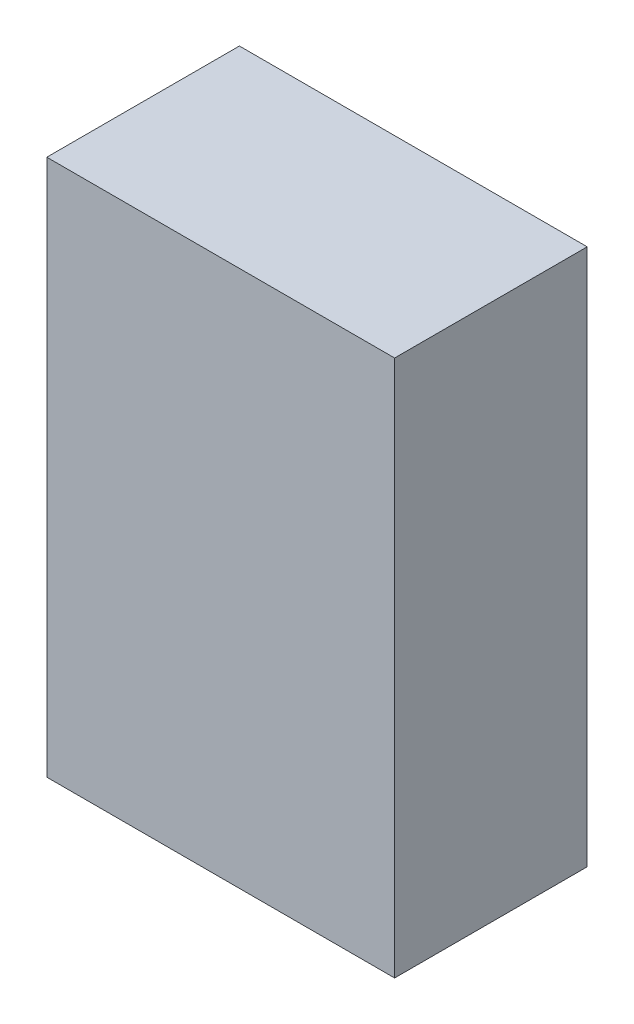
ISO-10303-21;
HEADER;
FILE_DESCRIPTION(('STEP AP214'),'2;1');
FILE_NAME('part.step','',(''),(''),'','','');
FILE_SCHEMA(('AUTOMOTIVE_DESIGN { 1 0 10303 214 1 1 1 1 }'));
ENDSEC;
DATA;
#1=APPLICATION_CONTEXT('core data for automotive mechanical design processes');
#2=APPLICATION_PROTOCOL_DEFINITION('international standard','automotive_design',2000,#1);
#3=PRODUCT_CONTEXT('',#1,'mechanical');
#4=PRODUCT('Part','Part','',(#3));
#5=PRODUCT_RELATED_PRODUCT_CATEGORY('part','',(#4));
#6=PRODUCT_DEFINITION_FORMATION('','',#4);
#7=PRODUCT_DEFINITION_CONTEXT('part definition',#1,'design');
#8=PRODUCT_DEFINITION('design','',#6,#7);
#9=PRODUCT_DEFINITION_SHAPE('','',#8);
#10=(LENGTH_UNIT() NAMED_UNIT(*) SI_UNIT(.MILLI.,.METRE.));
#11=(NAMED_UNIT(*) PLANE_ANGLE_UNIT() SI_UNIT($,.RADIAN.));
#12=(NAMED_UNIT(*) SI_UNIT($,.STERADIAN.) SOLID_ANGLE_UNIT());
#13=UNCERTAINTY_MEASURE_WITH_UNIT(LENGTH_MEASURE(1.E-05),#10,'distance_accuracy_value','');
#14=(GEOMETRIC_REPRESENTATION_CONTEXT(3) GLOBAL_UNCERTAINTY_ASSIGNED_CONTEXT((#13)) GLOBAL_UNIT_ASSIGNED_CONTEXT((#10,
#11,#12)) REPRESENTATION_CONTEXT('',''));
#15=CARTESIAN_POINT('',(0.,0.,0.));
#16=DIRECTION('',(0.,0.,1.));
#17=DIRECTION('',(1.,0.,0.));
#18=AXIS2_PLACEMENT_3D('',#15,#16,#17);
#19=CARTESIAN_POINT('',(-0.379619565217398,0.759239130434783,63.5));
#20=DIRECTION('',(1.,0.,0.));
#21=DIRECTION('',(0.,0.,-1.));
#22=AXIS2_PLACEMENT_3D('',#19,#20,#21);
#23=PLANE('',#22);
#24=DIRECTION('',(0.,-1.,0.));
#25=VECTOR('',#24,1.);
#26=CARTESIAN_POINT('',(-0.379619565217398,0.759239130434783,0.));
#27=LINE('',#26,#25);
#28=CARTESIAN_POINT('',(-0.379619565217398,177.8,0.));
#29=VERTEX_POINT('',#28);
#30=CARTESIAN_POINT('',(-0.379619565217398,0.759239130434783,0.));
#31=VERTEX_POINT('',#30);
#32=EDGE_CURVE('E74',#29,#31,#27,.T.);
#33=ORIENTED_EDGE('',*,*,#32,.T.);
#34=DIRECTION('',(0.,0.,-1.));
#35=VECTOR('',#34,1.);
#36=CARTESIAN_POINT('',(-0.379619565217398,0.759239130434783,63.5));
#37=LINE('',#36,#35);
#38=CARTESIAN_POINT('',(-0.379619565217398,0.759239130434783,63.5));
#39=VERTEX_POINT('',#38);
#40=EDGE_CURVE('E11',#39,#31,#37,.T.);
#41=ORIENTED_EDGE('',*,*,#40,.F.);
#42=DIRECTION('',(0.,-1.,0.));
#43=VECTOR('',#42,1.);
#44=CARTESIAN_POINT('',(-0.379619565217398,0.759239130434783,63.5));
#45=LINE('',#44,#43);
#46=CARTESIAN_POINT('',(-0.379619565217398,177.8,63.5));
#47=VERTEX_POINT('',#46);
#48=EDGE_CURVE('E92',#47,#39,#45,.T.);
#49=ORIENTED_EDGE('',*,*,#48,.F.);
#50=DIRECTION('',(0.,0.,-1.));
#51=VECTOR('',#50,1.);
#52=CARTESIAN_POINT('',(-0.379619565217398,177.8,63.5));
#53=LINE('',#52,#51);
#54=EDGE_CURVE('E86',#47,#29,#53,.T.);
#55=ORIENTED_EDGE('',*,*,#54,.T.);
#56=EDGE_LOOP('',(#33,#41,#49,#55));
#57=FACE_BOUND('',#56,.T.);
#58=ADVANCED_FACE('F30',(#57),#23,.F.);
#59=CARTESIAN_POINT('',(-0.379619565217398,0.759239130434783,63.5));
#60=DIRECTION('',(0.,1.,0.));
#61=DIRECTION('',(0.,0.,1.));
#62=AXIS2_PLACEMENT_3D('',#59,#60,#61);
#63=PLANE('',#62);
#64=DIRECTION('',(1.,0.,0.));
#65=VECTOR('',#64,1.);
#66=CARTESIAN_POINT('',(-0.379619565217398,0.759239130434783,0.));
#67=LINE('',#66,#65);
#68=CARTESIAN_POINT('',(114.3,0.759239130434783,0.));
#69=VERTEX_POINT('',#68);
#70=EDGE_CURVE('E70',#31,#69,#67,.T.);
#71=ORIENTED_EDGE('',*,*,#70,.T.);
#72=DIRECTION('',(0.,0.,-1.));
#73=VECTOR('',#72,1.);
#74=CARTESIAN_POINT('',(114.3,0.759239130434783,63.5));
#75=LINE('',#74,#73);
#76=CARTESIAN_POINT('',(114.3,0.759239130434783,63.5));
#77=VERTEX_POINT('',#76);
#78=EDGE_CURVE('E37',#77,#69,#75,.T.);
#79=ORIENTED_EDGE('',*,*,#78,.F.);
#80=DIRECTION('',(1.,0.,0.));
#81=VECTOR('',#80,1.);
#82=CARTESIAN_POINT('',(-0.379619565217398,0.759239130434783,63.5));
#83=LINE('',#82,#81);
#84=EDGE_CURVE('E82',#39,#77,#83,.T.);
#85=ORIENTED_EDGE('',*,*,#84,.F.);
#86=ORIENTED_EDGE('',*,*,#40,.T.);
#87=EDGE_LOOP('',(#71,#79,#85,#86));
#88=FACE_BOUND('',#87,.T.);
#89=ADVANCED_FACE('F81',(#88),#63,.F.);
#90=CARTESIAN_POINT('',(114.3,0.759239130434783,63.5));
#91=DIRECTION('',(-1.,0.,0.));
#92=DIRECTION('',(0.,0.,1.));
#93=AXIS2_PLACEMENT_3D('',#90,#91,#92);
#94=PLANE('',#93);
#95=DIRECTION('',(0.,1.,0.));
#96=VECTOR('',#95,1.);
#97=CARTESIAN_POINT('',(114.3,0.759239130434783,0.));
#98=LINE('',#97,#96);
#99=CARTESIAN_POINT('',(114.3,177.8,0.));
#100=VERTEX_POINT('',#99);
#101=EDGE_CURVE('E75',#69,#100,#98,.T.);
#102=ORIENTED_EDGE('',*,*,#101,.T.);
#103=DIRECTION('',(0.,0.,-1.));
#104=VECTOR('',#103,1.);
#105=CARTESIAN_POINT('',(114.3,177.8,63.5));
#106=LINE('',#105,#104);
#107=CARTESIAN_POINT('',(114.3,177.8,63.5));
#108=VERTEX_POINT('',#107);
#109=EDGE_CURVE('E98',#108,#100,#106,.T.);
#110=ORIENTED_EDGE('',*,*,#109,.F.);
#111=DIRECTION('',(0.,1.,0.));
#112=VECTOR('',#111,1.);
#113=CARTESIAN_POINT('',(114.3,0.759239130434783,63.5));
#114=LINE('',#113,#112);
#115=EDGE_CURVE('E49',#77,#108,#114,.T.);
#116=ORIENTED_EDGE('',*,*,#115,.F.);
#117=ORIENTED_EDGE('',*,*,#78,.T.);
#118=EDGE_LOOP('',(#102,#110,#116,#117));
#119=FACE_BOUND('',#118,.T.);
#120=ADVANCED_FACE('F101',(#119),#94,.F.);
#121=CARTESIAN_POINT('',(-0.379619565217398,177.8,63.5));
#122=DIRECTION('',(0.,-1.,0.));
#123=DIRECTION('',(0.,0.,-1.));
#124=AXIS2_PLACEMENT_3D('',#121,#122,#123);
#125=PLANE('',#124);
#126=DIRECTION('',(-1.,0.,0.));
#127=VECTOR('',#126,1.);
#128=CARTESIAN_POINT('',(-0.379619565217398,177.8,0.));
#129=LINE('',#128,#127);
#130=EDGE_CURVE('E90',#100,#29,#129,.T.);
#131=ORIENTED_EDGE('',*,*,#130,.T.);
#132=ORIENTED_EDGE('',*,*,#54,.F.);
#133=DIRECTION('',(-1.,0.,0.));
#134=VECTOR('',#133,1.);
#135=CARTESIAN_POINT('',(-0.379619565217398,177.8,63.5));
#136=LINE('',#135,#134);
#137=EDGE_CURVE('E44',#108,#47,#136,.T.);
#138=ORIENTED_EDGE('',*,*,#137,.F.);
#139=ORIENTED_EDGE('',*,*,#109,.T.);
#140=EDGE_LOOP('',(#131,#132,#138,#139));
#141=FACE_BOUND('',#140,.T.);
#142=ADVANCED_FACE('F103',(#141),#125,.F.);
#143=CARTESIAN_POINT('',(-0.379619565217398,177.8,63.5));
#144=DIRECTION('',(0.,0.,-1.));
#145=DIRECTION('',(-1.,0.,0.));
#146=AXIS2_PLACEMENT_3D('',#143,#144,#145);
#147=PLANE('',#146);
#148=ORIENTED_EDGE('',*,*,#48,.T.);
#149=ORIENTED_EDGE('',*,*,#84,.T.);
#150=ORIENTED_EDGE('',*,*,#115,.T.);
#151=ORIENTED_EDGE('',*,*,#137,.T.);
#152=EDGE_LOOP('',(#148,#149,#150,#151));
#153=FACE_BOUND('',#152,.T.);
#154=ADVANCED_FACE('F104',(#153),#147,.F.);
#155=CARTESIAN_POINT('',(-0.379619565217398,177.8,0.));
#156=DIRECTION('',(0.,0.,-1.));
#157=DIRECTION('',(-1.,0.,0.));
#158=AXIS2_PLACEMENT_3D('',#155,#156,#157);
#159=PLANE('',#158);
#160=ORIENTED_EDGE('',*,*,#32,.F.);
#161=ORIENTED_EDGE('',*,*,#130,.F.);
#162=ORIENTED_EDGE('',*,*,#101,.F.);
#163=ORIENTED_EDGE('',*,*,#70,.F.);
#164=EDGE_LOOP('',(#160,#161,#162,#163));
#165=FACE_BOUND('',#164,.T.);
#166=ADVANCED_FACE('F71',(#165),#159,.T.);
#167=CLOSED_SHELL('',(#58,#89,#120,#142,#154,#166));
#168=MANIFOLD_SOLID_BREP('B2',#167);
#169=ADVANCED_BREP_SHAPE_REPRESENTATION('',(#18,#168),#14);
#170=SHAPE_DEFINITION_REPRESENTATION(#9,#169);
ENDSEC;
END-ISO-10303-21;
